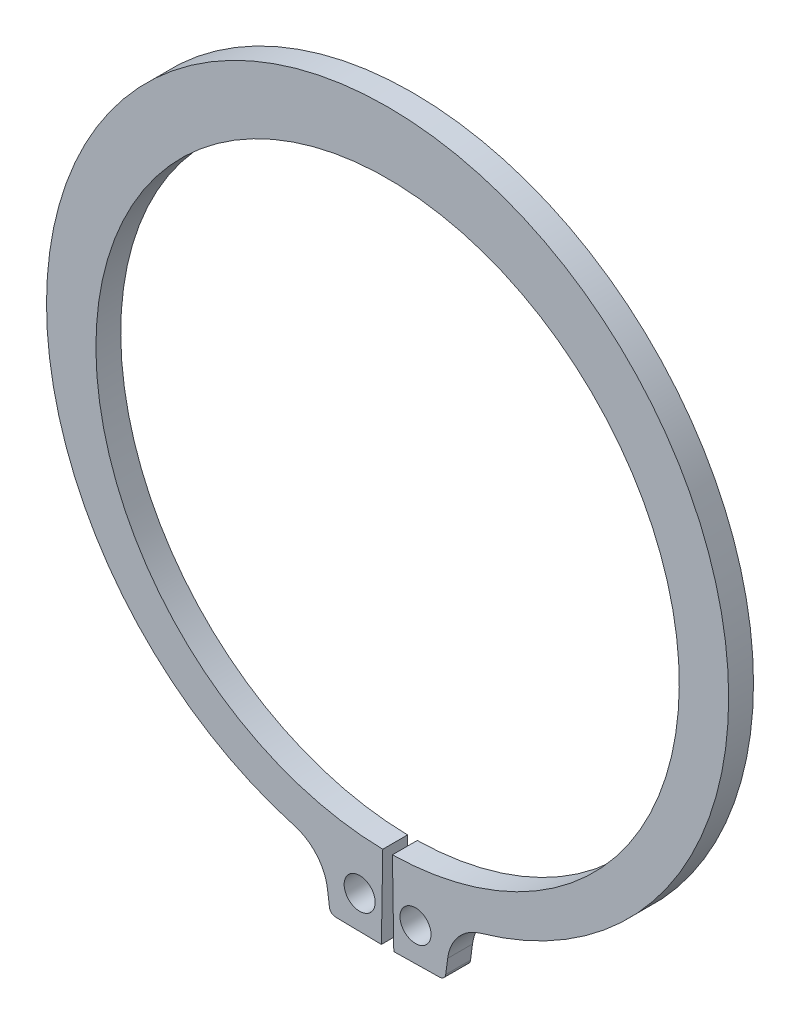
ISO-10303-21;
HEADER;
FILE_DESCRIPTION(('STEP AP214'),'2;1');
FILE_NAME('part.step','',(''),(''),'','','');
FILE_SCHEMA(('AUTOMOTIVE_DESIGN { 1 0 10303 214 1 1 1 1 }'));
ENDSEC;
DATA;
#1=APPLICATION_CONTEXT('core data for automotive mechanical design processes');
#2=APPLICATION_PROTOCOL_DEFINITION('international standard','automotive_design',2000,#1);
#3=PRODUCT_CONTEXT('',#1,'mechanical');
#4=PRODUCT('Part','Part','',(#3));
#5=PRODUCT_RELATED_PRODUCT_CATEGORY('part','',(#4));
#6=PRODUCT_DEFINITION_FORMATION('','',#4);
#7=PRODUCT_DEFINITION_CONTEXT('part definition',#1,'design');
#8=PRODUCT_DEFINITION('design','',#6,#7);
#9=PRODUCT_DEFINITION_SHAPE('','',#8);
#10=(LENGTH_UNIT() NAMED_UNIT(*) SI_UNIT(.MILLI.,.METRE.));
#11=(NAMED_UNIT(*) PLANE_ANGLE_UNIT() SI_UNIT($,.RADIAN.));
#12=(NAMED_UNIT(*) SI_UNIT($,.STERADIAN.) SOLID_ANGLE_UNIT());
#13=UNCERTAINTY_MEASURE_WITH_UNIT(LENGTH_MEASURE(1.E-05),#10,'distance_accuracy_value','');
#14=(GEOMETRIC_REPRESENTATION_CONTEXT(3) GLOBAL_UNCERTAINTY_ASSIGNED_CONTEXT((#13)) GLOBAL_UNIT_ASSIGNED_CONTEXT((#10,
#11,#12)) REPRESENTATION_CONTEXT('',''));
#15=CARTESIAN_POINT('',(0.,0.,0.));
#16=DIRECTION('',(0.,0.,1.));
#17=DIRECTION('',(1.,0.,0.));
#18=AXIS2_PLACEMENT_3D('',#15,#16,#17);
#19=CARTESIAN_POINT('',(0.,0.,-2.));
#20=DIRECTION('',(0.,0.,1.));
#21=DIRECTION('',(1.,0.,0.));
#22=AXIS2_PLACEMENT_3D('',#19,#20,#21);
#23=CYLINDRICAL_SURFACE('',#22,23.5);
#24=CARTESIAN_POINT('',(0.,0.,0.));
#25=DIRECTION('',(0.,0.,-1.));
#26=DIRECTION('',(1.,0.,0.));
#27=AXIS2_PLACEMENT_3D('',#24,#25,#26);
#28=CIRCLE('',#27,23.5);
#29=CARTESIAN_POINT('',(-0.389072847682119,-23.4967789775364,0.));
#30=VERTEX_POINT('',#29);
#31=CARTESIAN_POINT('',(0.389072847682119,-23.4967789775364,0.));
#32=VERTEX_POINT('',#31);
#33=EDGE_CURVE('E151',#30,#32,#28,.T.);
#34=ORIENTED_EDGE('',*,*,#33,.F.);
#35=DIRECTION('',(0.,0.,1.));
#36=VECTOR('',#35,1.);
#37=CARTESIAN_POINT('',(-0.389072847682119,-23.4967789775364,-2.));
#38=LINE('',#37,#36);
#39=CARTESIAN_POINT('',(-0.389072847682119,-23.4967789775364,-2.));
#40=VERTEX_POINT('',#39);
#41=EDGE_CURVE('E11',#40,#30,#38,.T.);
#42=ORIENTED_EDGE('',*,*,#41,.F.);
#43=CARTESIAN_POINT('',(0.,0.,-2.));
#44=DIRECTION('',(0.,0.,-1.));
#45=DIRECTION('',(1.,0.,0.));
#46=AXIS2_PLACEMENT_3D('',#43,#44,#45);
#47=CIRCLE('',#46,23.5);
#48=CARTESIAN_POINT('',(0.389072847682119,-23.4967789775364,-2.));
#49=VERTEX_POINT('',#48);
#50=EDGE_CURVE('E184',#40,#49,#47,.T.);
#51=ORIENTED_EDGE('',*,*,#50,.T.);
#52=DIRECTION('',(0.,0.,1.));
#53=VECTOR('',#52,1.);
#54=CARTESIAN_POINT('',(0.389072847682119,-23.4967789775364,-2.));
#55=LINE('',#54,#53);
#56=EDGE_CURVE('E33',#49,#32,#55,.T.);
#57=ORIENTED_EDGE('',*,*,#56,.T.);
#58=EDGE_LOOP('',(#34,#42,#51,#57));
#59=FACE_BOUND('',#58,.T.);
#60=ADVANCED_FACE('F30',(#59),#23,.F.);
#61=CARTESIAN_POINT('',(-0.389072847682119,-23.4967789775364,-2.));
#62=DIRECTION('',(0.999862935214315,-0.0165562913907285,0.));
#63=DIRECTION('',(0.0165562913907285,0.999862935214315,0.));
#64=AXIS2_PLACEMENT_3D('',#61,#62,#63);
#65=PLANE('',#64);
#66=DIRECTION('',(0.0165562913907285,0.999862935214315,0.));
#67=VECTOR('',#66,1.);
#68=CARTESIAN_POINT('',(-0.389072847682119,-23.4967789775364,0.));
#69=LINE('',#68,#67);
#70=CARTESIAN_POINT('',(-0.5,-30.1958606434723,0.));
#71=VERTEX_POINT('',#70);
#72=EDGE_CURVE('E182',#71,#30,#69,.T.);
#73=ORIENTED_EDGE('',*,*,#72,.F.);
#74=DIRECTION('',(0.,0.,1.));
#75=VECTOR('',#74,1.);
#76=CARTESIAN_POINT('',(-0.5,-30.1958606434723,-2.));
#77=LINE('',#76,#75);
#78=CARTESIAN_POINT('',(-0.5,-30.1958606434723,-2.));
#79=VERTEX_POINT('',#78);
#80=EDGE_CURVE('E39',#79,#71,#77,.T.);
#81=ORIENTED_EDGE('',*,*,#80,.F.);
#82=DIRECTION('',(0.0165562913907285,0.999862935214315,0.));
#83=VECTOR('',#82,1.);
#84=CARTESIAN_POINT('',(-0.389072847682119,-23.4967789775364,-2.));
#85=LINE('',#84,#83);
#86=EDGE_CURVE('E141',#79,#40,#85,.T.);
#87=ORIENTED_EDGE('',*,*,#86,.T.);
#88=ORIENTED_EDGE('',*,*,#41,.T.);
#89=EDGE_LOOP('',(#73,#81,#87,#88));
#90=FACE_BOUND('',#89,.T.);
#91=ADVANCED_FACE('F204',(#90),#65,.T.);
#92=CARTESIAN_POINT('',(-0.5,-30.1958606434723,-2.));
#93=DIRECTION('',(-0.0165562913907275,-0.999862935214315,0.));
#94=DIRECTION('',(0.999862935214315,-0.0165562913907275,0.));
#95=AXIS2_PLACEMENT_3D('',#92,#93,#94);
#96=PLANE('',#95);
#97=DIRECTION('',(0.999862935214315,-0.0165562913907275,0.));
#98=VECTOR('',#97,1.);
#99=CARTESIAN_POINT('',(-0.5,-30.1958606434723,0.));
#100=LINE('',#99,#98);
#101=CARTESIAN_POINT('',(-4.19512250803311,-30.134674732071,0.));
#102=VERTEX_POINT('',#101);
#103=EDGE_CURVE('E128',#102,#71,#100,.T.);
#104=ORIENTED_EDGE('',*,*,#103,.F.);
#105=DIRECTION('',(0.,0.,1.));
#106=VECTOR('',#105,1.);
#107=CARTESIAN_POINT('',(-4.19512250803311,-30.134674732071,-2.));
#108=LINE('',#107,#106);
#109=CARTESIAN_POINT('',(-4.19512250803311,-30.134674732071,-2.));
#110=VERTEX_POINT('',#109);
#111=EDGE_CURVE('E123',#110,#102,#108,.T.);
#112=ORIENTED_EDGE('',*,*,#111,.F.);
#113=DIRECTION('',(0.999862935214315,-0.0165562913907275,0.));
#114=VECTOR('',#113,1.);
#115=CARTESIAN_POINT('',(-0.5,-30.1958606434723,-2.));
#116=LINE('',#115,#114);
#117=EDGE_CURVE('E126',#110,#79,#116,.T.);
#118=ORIENTED_EDGE('',*,*,#117,.T.);
#119=ORIENTED_EDGE('',*,*,#80,.T.);
#120=EDGE_LOOP('',(#104,#112,#118,#119));
#121=FACE_BOUND('',#120,.T.);
#122=ADVANCED_FACE('F125',(#121),#96,.T.);
#123=CARTESIAN_POINT('',(-4.18684436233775,-29.6347432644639,-2.));
#124=DIRECTION('',(0.,0.,1.));
#125=DIRECTION('',(1.,0.,0.));
#126=AXIS2_PLACEMENT_3D('',#123,#124,#125);
#127=CYLINDRICAL_SURFACE('',#126,0.499999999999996);
#128=CARTESIAN_POINT('',(-4.18684436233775,-29.6347432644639,0.));
#129=DIRECTION('',(0.,0.,1.));
#130=DIRECTION('',(1.,0.,0.));
#131=AXIS2_PLACEMENT_3D('',#128,#129,#130);
#132=CIRCLE('',#131,0.499999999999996);
#133=CARTESIAN_POINT('',(-4.68256679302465,-29.7000063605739,0.));
#134=VERTEX_POINT('',#133);
#135=EDGE_CURVE('E179',#134,#102,#132,.T.);
#136=ORIENTED_EDGE('',*,*,#135,.F.);
#137=DIRECTION('',(0.,0.,1.));
#138=VECTOR('',#137,1.);
#139=CARTESIAN_POINT('',(-4.68256679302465,-29.7000063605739,-2.));
#140=LINE('',#139,#138);
#141=CARTESIAN_POINT('',(-4.68256679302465,-29.7000063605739,-2.));
#142=VERTEX_POINT('',#141);
#143=EDGE_CURVE('E133',#142,#134,#140,.T.);
#144=ORIENTED_EDGE('',*,*,#143,.F.);
#145=CARTESIAN_POINT('',(-4.18684436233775,-29.6347432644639,-2.));
#146=DIRECTION('',(0.,0.,1.));
#147=DIRECTION('',(1.,0.,0.));
#148=AXIS2_PLACEMENT_3D('',#145,#146,#147);
#149=CIRCLE('',#148,0.499999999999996);
#150=EDGE_CURVE('E139',#142,#110,#149,.T.);
#151=ORIENTED_EDGE('',*,*,#150,.T.);
#152=ORIENTED_EDGE('',*,*,#111,.T.);
#153=EDGE_LOOP('',(#136,#144,#151,#152));
#154=FACE_BOUND('',#153,.T.);
#155=ADVANCED_FACE('F143',(#154),#127,.T.);
#156=CARTESIAN_POINT('',(-4.84142055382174,-28.4933922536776,-2.));
#157=DIRECTION('',(-0.99144486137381,-0.130526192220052,0.));
#158=DIRECTION('',(0.130526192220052,-0.99144486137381,0.));
#159=AXIS2_PLACEMENT_3D('',#156,#157,#158);
#160=PLANE('',#159);
#161=DIRECTION('',(0.130526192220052,-0.99144486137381,0.));
#162=VECTOR('',#161,1.);
#163=CARTESIAN_POINT('',(-4.84142055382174,-28.4933922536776,0.));
#164=LINE('',#163,#162);
#165=CARTESIAN_POINT('',(-4.84142055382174,-28.4933922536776,0.));
#166=VERTEX_POINT('',#165);
#167=EDGE_CURVE('E176',#166,#134,#164,.T.);
#168=ORIENTED_EDGE('',*,*,#167,.F.);
#169=DIRECTION('',(0.,0.,1.));
#170=VECTOR('',#169,1.);
#171=CARTESIAN_POINT('',(-4.84142055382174,-28.4933922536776,-2.));
#172=LINE('',#171,#170);
#173=CARTESIAN_POINT('',(-4.84142055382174,-28.4933922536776,-2.));
#174=VERTEX_POINT('',#173);
#175=EDGE_CURVE('E188',#174,#166,#172,.T.);
#176=ORIENTED_EDGE('',*,*,#175,.F.);
#177=DIRECTION('',(0.130526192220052,-0.99144486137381,0.));
#178=VECTOR('',#177,1.);
#179=CARTESIAN_POINT('',(-4.84142055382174,-28.4933922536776,-2.));
#180=LINE('',#179,#178);
#181=EDGE_CURVE('E144',#174,#142,#180,.T.);
#182=ORIENTED_EDGE('',*,*,#181,.T.);
#183=ORIENTED_EDGE('',*,*,#143,.T.);
#184=EDGE_LOOP('',(#168,#176,#182,#183));
#185=FACE_BOUND('',#184,.T.);
#186=ADVANCED_FACE('F217',(#185),#160,.T.);
#187=CARTESIAN_POINT('',(-8.50958973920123,-28.9763158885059,-2.));
#188=DIRECTION('',(0.,0.,1.));
#189=DIRECTION('',(1.,0.,0.));
#190=AXIS2_PLACEMENT_3D('',#187,#188,#189);
#191=CYLINDRICAL_SURFACE('',#190,3.69982167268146);
#192=CARTESIAN_POINT('',(-8.50958973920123,-28.9763158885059,0.));
#193=DIRECTION('',(0.,0.,-1.));
#194=DIRECTION('',(1.,0.,0.));
#195=AXIS2_PLACEMENT_3D('',#192,#193,#194);
#196=CIRCLE('',#195,3.69982167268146);
#197=CARTESIAN_POINT('',(-7.49983812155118,-25.4169504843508,0.));
#198=VERTEX_POINT('',#197);
#199=EDGE_CURVE('E173',#198,#166,#196,.T.);
#200=ORIENTED_EDGE('',*,*,#199,.F.);
#201=DIRECTION('',(0.,0.,1.));
#202=VECTOR('',#201,1.);
#203=CARTESIAN_POINT('',(-7.49983812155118,-25.4169504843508,-2.));
#204=LINE('',#203,#202);
#205=CARTESIAN_POINT('',(-7.49983812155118,-25.4169504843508,-2.));
#206=VERTEX_POINT('',#205);
#207=EDGE_CURVE('E190',#206,#198,#204,.T.);
#208=ORIENTED_EDGE('',*,*,#207,.F.);
#209=CARTESIAN_POINT('',(-8.50958973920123,-28.9763158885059,-2.));
#210=DIRECTION('',(0.,0.,-1.));
#211=DIRECTION('',(1.,0.,0.));
#212=AXIS2_PLACEMENT_3D('',#209,#210,#211);
#213=CIRCLE('',#212,3.69982167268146);
#214=EDGE_CURVE('E146',#206,#174,#213,.T.);
#215=ORIENTED_EDGE('',*,*,#214,.T.);
#216=ORIENTED_EDGE('',*,*,#175,.T.);
#217=EDGE_LOOP('',(#200,#208,#215,#216));
#218=FACE_BOUND('',#217,.T.);
#219=ADVANCED_FACE('F220',(#218),#191,.F.);
#220=CARTESIAN_POINT('',(0.,1.01991169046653,-2.));
#221=DIRECTION('',(0.,0.,1.));
#222=DIRECTION('',(1.,0.,0.));
#223=AXIS2_PLACEMENT_3D('',#220,#221,#222);
#224=CYLINDRICAL_SURFACE('',#223,27.4800883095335);
#225=CARTESIAN_POINT('',(0.,1.01991169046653,0.));
#226=DIRECTION('',(0.,0.,1.));
#227=DIRECTION('',(1.,0.,0.));
#228=AXIS2_PLACEMENT_3D('',#225,#226,#227);
#229=CIRCLE('',#228,27.4800883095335);
#230=CARTESIAN_POINT('',(7.49983812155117,-25.4169504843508,0.));
#231=VERTEX_POINT('',#230);
#232=EDGE_CURVE('E170',#231,#198,#229,.T.);
#233=ORIENTED_EDGE('',*,*,#232,.F.);
#234=DIRECTION('',(0.,0.,1.));
#235=VECTOR('',#234,1.);
#236=CARTESIAN_POINT('',(7.49983812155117,-25.4169504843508,-2.));
#237=LINE('',#236,#235);
#238=CARTESIAN_POINT('',(7.49983812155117,-25.4169504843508,-2.));
#239=VERTEX_POINT('',#238);
#240=EDGE_CURVE('E192',#239,#231,#237,.T.);
#241=ORIENTED_EDGE('',*,*,#240,.F.);
#242=CARTESIAN_POINT('',(0.,1.01991169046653,-2.));
#243=DIRECTION('',(0.,0.,1.));
#244=DIRECTION('',(1.,0.,0.));
#245=AXIS2_PLACEMENT_3D('',#242,#243,#244);
#246=CIRCLE('',#245,27.4800883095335);
#247=EDGE_CURVE('E294',#239,#206,#246,.T.);
#248=ORIENTED_EDGE('',*,*,#247,.T.);
#249=ORIENTED_EDGE('',*,*,#207,.T.);
#250=EDGE_LOOP('',(#233,#241,#248,#249));
#251=FACE_BOUND('',#250,.T.);
#252=ADVANCED_FACE('F224',(#251),#224,.T.);
#253=CARTESIAN_POINT('',(8.50958973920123,-28.9763158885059,-2.));
#254=DIRECTION('',(0.,0.,1.));
#255=DIRECTION('',(1.,0.,0.));
#256=AXIS2_PLACEMENT_3D('',#253,#254,#255);
#257=CYLINDRICAL_SURFACE('',#256,3.69982167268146);
#258=CARTESIAN_POINT('',(8.50958973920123,-28.9763158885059,0.));
#259=DIRECTION('',(0.,0.,-1.));
#260=DIRECTION('',(1.,0.,0.));
#261=AXIS2_PLACEMENT_3D('',#258,#259,#260);
#262=CIRCLE('',#261,3.69982167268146);
#263=CARTESIAN_POINT('',(4.84142055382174,-28.4933922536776,0.));
#264=VERTEX_POINT('',#263);
#265=EDGE_CURVE('E167',#264,#231,#262,.T.);
#266=ORIENTED_EDGE('',*,*,#265,.F.);
#267=DIRECTION('',(0.,0.,1.));
#268=VECTOR('',#267,1.);
#269=CARTESIAN_POINT('',(4.84142055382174,-28.4933922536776,-2.));
#270=LINE('',#269,#268);
#271=CARTESIAN_POINT('',(4.84142055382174,-28.4933922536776,-2.));
#272=VERTEX_POINT('',#271);
#273=EDGE_CURVE('E194',#272,#264,#270,.T.);
#274=ORIENTED_EDGE('',*,*,#273,.F.);
#275=CARTESIAN_POINT('',(8.50958973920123,-28.9763158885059,-2.));
#276=DIRECTION('',(0.,0.,-1.));
#277=DIRECTION('',(1.,0.,0.));
#278=AXIS2_PLACEMENT_3D('',#275,#276,#277);
#279=CIRCLE('',#278,3.69982167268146);
#280=EDGE_CURVE('E291',#272,#239,#279,.T.);
#281=ORIENTED_EDGE('',*,*,#280,.T.);
#282=ORIENTED_EDGE('',*,*,#240,.T.);
#283=EDGE_LOOP('',(#266,#274,#281,#282));
#284=FACE_BOUND('',#283,.T.);
#285=ADVANCED_FACE('F228',(#284),#257,.F.);
#286=CARTESIAN_POINT('',(4.84142055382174,-28.4933922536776,-2.));
#287=DIRECTION('',(0.99144486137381,-0.130526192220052,0.));
#288=DIRECTION('',(0.130526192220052,0.99144486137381,0.));
#289=AXIS2_PLACEMENT_3D('',#286,#287,#288);
#290=PLANE('',#289);
#291=DIRECTION('',(0.130526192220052,0.99144486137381,0.));
#292=VECTOR('',#291,1.);
#293=CARTESIAN_POINT('',(4.84142055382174,-28.4933922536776,0.));
#294=LINE('',#293,#292);
#295=CARTESIAN_POINT('',(4.68256679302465,-29.7000063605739,0.));
#296=VERTEX_POINT('',#295);
#297=EDGE_CURVE('E164',#296,#264,#294,.T.);
#298=ORIENTED_EDGE('',*,*,#297,.F.);
#299=DIRECTION('',(0.,0.,1.));
#300=VECTOR('',#299,1.);
#301=CARTESIAN_POINT('',(4.68256679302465,-29.7000063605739,-2.));
#302=LINE('',#301,#300);
#303=CARTESIAN_POINT('',(4.68256679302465,-29.7000063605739,-2.));
#304=VERTEX_POINT('',#303);
#305=EDGE_CURVE('E196',#304,#296,#302,.T.);
#306=ORIENTED_EDGE('',*,*,#305,.F.);
#307=DIRECTION('',(0.130526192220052,0.99144486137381,0.));
#308=VECTOR('',#307,1.);
#309=CARTESIAN_POINT('',(4.84142055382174,-28.4933922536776,-2.));
#310=LINE('',#309,#308);
#311=EDGE_CURVE('E288',#304,#272,#310,.T.);
#312=ORIENTED_EDGE('',*,*,#311,.T.);
#313=ORIENTED_EDGE('',*,*,#273,.T.);
#314=EDGE_LOOP('',(#298,#306,#312,#313));
#315=FACE_BOUND('',#314,.T.);
#316=ADVANCED_FACE('F232',(#315),#290,.T.);
#317=CARTESIAN_POINT('',(4.18684436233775,-29.6347432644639,-2.));
#318=DIRECTION('',(0.,0.,1.));
#319=DIRECTION('',(1.,0.,0.));
#320=AXIS2_PLACEMENT_3D('',#317,#318,#319);
#321=CYLINDRICAL_SURFACE('',#320,0.499999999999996);
#322=CARTESIAN_POINT('',(4.18684436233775,-29.6347432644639,0.));
#323=DIRECTION('',(0.,0.,1.));
#324=DIRECTION('',(-1.,0.,0.));
#325=AXIS2_PLACEMENT_3D('',#322,#323,#324);
#326=CIRCLE('',#325,0.499999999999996);
#327=CARTESIAN_POINT('',(4.19512250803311,-30.134674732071,0.));
#328=VERTEX_POINT('',#327);
#329=EDGE_CURVE('E161',#328,#296,#326,.T.);
#330=ORIENTED_EDGE('',*,*,#329,.F.);
#331=DIRECTION('',(0.,0.,1.));
#332=VECTOR('',#331,1.);
#333=CARTESIAN_POINT('',(4.19512250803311,-30.134674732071,-2.));
#334=LINE('',#333,#332);
#335=CARTESIAN_POINT('',(4.19512250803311,-30.134674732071,-2.));
#336=VERTEX_POINT('',#335);
#337=EDGE_CURVE('E198',#336,#328,#334,.T.);
#338=ORIENTED_EDGE('',*,*,#337,.F.);
#339=CARTESIAN_POINT('',(4.18684436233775,-29.6347432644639,-2.));
#340=DIRECTION('',(0.,0.,1.));
#341=DIRECTION('',(-1.,0.,0.));
#342=AXIS2_PLACEMENT_3D('',#339,#340,#341);
#343=CIRCLE('',#342,0.499999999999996);
#344=EDGE_CURVE('E285',#336,#304,#343,.T.);
#345=ORIENTED_EDGE('',*,*,#344,.T.);
#346=ORIENTED_EDGE('',*,*,#305,.T.);
#347=EDGE_LOOP('',(#330,#338,#345,#346));
#348=FACE_BOUND('',#347,.T.);
#349=ADVANCED_FACE('F236',(#348),#321,.T.);
#350=CARTESIAN_POINT('',(0.5,-30.1958606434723,-2.));
#351=DIRECTION('',(0.0165562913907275,-0.999862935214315,0.));
#352=DIRECTION('',(0.999862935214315,0.0165562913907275,0.));
#353=AXIS2_PLACEMENT_3D('',#350,#351,#352);
#354=PLANE('',#353);
#355=DIRECTION('',(0.999862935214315,0.0165562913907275,0.));
#356=VECTOR('',#355,1.);
#357=CARTESIAN_POINT('',(0.5,-30.1958606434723,0.));
#358=LINE('',#357,#356);
#359=CARTESIAN_POINT('',(0.5,-30.1958606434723,0.));
#360=VERTEX_POINT('',#359);
#361=EDGE_CURVE('E158',#360,#328,#358,.T.);
#362=ORIENTED_EDGE('',*,*,#361,.F.);
#363=DIRECTION('',(0.,0.,1.));
#364=VECTOR('',#363,1.);
#365=CARTESIAN_POINT('',(0.5,-30.1958606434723,-2.));
#366=LINE('',#365,#364);
#367=CARTESIAN_POINT('',(0.5,-30.1958606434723,-2.));
#368=VERTEX_POINT('',#367);
#369=EDGE_CURVE('E199',#368,#360,#366,.T.);
#370=ORIENTED_EDGE('',*,*,#369,.F.);
#371=DIRECTION('',(0.999862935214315,0.0165562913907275,0.));
#372=VECTOR('',#371,1.);
#373=CARTESIAN_POINT('',(0.5,-30.1958606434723,-2.));
#374=LINE('',#373,#372);
#375=EDGE_CURVE('E282',#368,#336,#374,.T.);
#376=ORIENTED_EDGE('',*,*,#375,.T.);
#377=ORIENTED_EDGE('',*,*,#337,.T.);
#378=EDGE_LOOP('',(#362,#370,#376,#377));
#379=FACE_BOUND('',#378,.T.);
#380=ADVANCED_FACE('F240',(#379),#354,.T.);
#381=CARTESIAN_POINT('',(0.389072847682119,-23.4967789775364,-2.));
#382=DIRECTION('',(-0.999862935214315,-0.0165562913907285,0.));
#383=DIRECTION('',(0.0165562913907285,-0.999862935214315,0.));
#384=AXIS2_PLACEMENT_3D('',#381,#382,#383);
#385=PLANE('',#384);
#386=DIRECTION('',(0.0165562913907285,-0.999862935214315,0.));
#387=VECTOR('',#386,1.);
#388=CARTESIAN_POINT('',(0.389072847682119,-23.4967789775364,0.));
#389=LINE('',#388,#387);
#390=EDGE_CURVE('E154',#32,#360,#389,.T.);
#391=ORIENTED_EDGE('',*,*,#390,.F.);
#392=ORIENTED_EDGE('',*,*,#56,.F.);
#393=DIRECTION('',(0.0165562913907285,-0.999862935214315,0.));
#394=VECTOR('',#393,1.);
#395=CARTESIAN_POINT('',(0.389072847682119,-23.4967789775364,-2.));
#396=LINE('',#395,#394);
#397=EDGE_CURVE('E280',#49,#368,#396,.T.);
#398=ORIENTED_EDGE('',*,*,#397,.T.);
#399=ORIENTED_EDGE('',*,*,#369,.T.);
#400=EDGE_LOOP('',(#391,#392,#398,#399));
#401=FACE_BOUND('',#400,.T.);
#402=ADVANCED_FACE('F201',(#401),#385,.T.);
#403=CARTESIAN_POINT('',(0.,0.,-2.));
#404=DIRECTION('',(0.,0.,1.));
#405=DIRECTION('',(1.,0.,0.));
#406=AXIS2_PLACEMENT_3D('',#403,#404,#405);
#407=PLANE('',#406);
#408=CARTESIAN_POINT('',(-2.25,-27.5081351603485,-2.));
#409=DIRECTION('',(0.,0.,1.));
#410=DIRECTION('',(1.,0.,0.));
#411=AXIS2_PLACEMENT_3D('',#408,#409,#410);
#412=CIRCLE('',#411,1.25);
#413=CARTESIAN_POINT('',(-0.999999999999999,-27.5081351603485,-2.));
#414=VERTEX_POINT('',#413);
#415=EDGE_CURVE('E267',#414,#414,#412,.T.);
#416=ORIENTED_EDGE('',*,*,#415,.T.);
#417=EDGE_LOOP('',(#416));
#418=FACE_BOUND('',#417,.T.);
#419=CARTESIAN_POINT('',(2.25,-27.5081351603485,-2.));
#420=DIRECTION('',(0.,0.,1.));
#421=DIRECTION('',(1.,0.,0.));
#422=AXIS2_PLACEMENT_3D('',#419,#420,#421);
#423=CIRCLE('',#422,1.25);
#424=CARTESIAN_POINT('',(3.5,-27.5081351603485,-2.));
#425=VERTEX_POINT('',#424);
#426=EDGE_CURVE('E155',#425,#425,#423,.T.);
#427=ORIENTED_EDGE('',*,*,#426,.T.);
#428=EDGE_LOOP('',(#427));
#429=FACE_BOUND('',#428,.T.);
#430=ORIENTED_EDGE('',*,*,#50,.F.);
#431=ORIENTED_EDGE('',*,*,#86,.F.);
#432=ORIENTED_EDGE('',*,*,#117,.F.);
#433=ORIENTED_EDGE('',*,*,#150,.F.);
#434=ORIENTED_EDGE('',*,*,#181,.F.);
#435=ORIENTED_EDGE('',*,*,#214,.F.);
#436=ORIENTED_EDGE('',*,*,#247,.F.);
#437=ORIENTED_EDGE('',*,*,#280,.F.);
#438=ORIENTED_EDGE('',*,*,#311,.F.);
#439=ORIENTED_EDGE('',*,*,#344,.F.);
#440=ORIENTED_EDGE('',*,*,#375,.F.);
#441=ORIENTED_EDGE('',*,*,#397,.F.);
#442=EDGE_LOOP('',(#430,#431,#432,#433,#434,#435,#436,#437,#438,#439,#440,#441));
#443=FACE_BOUND('',#442,.T.);
#444=ADVANCED_FACE('F137',(#418,#429,#443),#407,.F.);
#445=CARTESIAN_POINT('',(0.,0.,0.));
#446=DIRECTION('',(0.,0.,1.));
#447=DIRECTION('',(1.,0.,0.));
#448=AXIS2_PLACEMENT_3D('',#445,#446,#447);
#449=PLANE('',#448);
#450=CARTESIAN_POINT('',(-2.25,-27.5081351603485,0.));
#451=DIRECTION('',(0.,0.,1.));
#452=DIRECTION('',(1.,0.,0.));
#453=AXIS2_PLACEMENT_3D('',#450,#451,#452);
#454=CIRCLE('',#453,1.25);
#455=CARTESIAN_POINT('',(-0.999999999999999,-27.5081351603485,0.));
#456=VERTEX_POINT('',#455);
#457=EDGE_CURVE('E270',#456,#456,#454,.T.);
#458=ORIENTED_EDGE('',*,*,#457,.F.);
#459=EDGE_LOOP('',(#458));
#460=FACE_BOUND('',#459,.T.);
#461=CARTESIAN_POINT('',(2.25,-27.5081351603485,0.));
#462=DIRECTION('',(0.,0.,1.));
#463=DIRECTION('',(1.,0.,0.));
#464=AXIS2_PLACEMENT_3D('',#461,#462,#463);
#465=CIRCLE('',#464,1.25);
#466=CARTESIAN_POINT('',(3.5,-27.5081351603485,0.));
#467=VERTEX_POINT('',#466);
#468=EDGE_CURVE('E272',#467,#467,#465,.T.);
#469=ORIENTED_EDGE('',*,*,#468,.F.);
#470=EDGE_LOOP('',(#469));
#471=FACE_BOUND('',#470,.T.);
#472=ORIENTED_EDGE('',*,*,#33,.T.);
#473=ORIENTED_EDGE('',*,*,#390,.T.);
#474=ORIENTED_EDGE('',*,*,#361,.T.);
#475=ORIENTED_EDGE('',*,*,#329,.T.);
#476=ORIENTED_EDGE('',*,*,#297,.T.);
#477=ORIENTED_EDGE('',*,*,#265,.T.);
#478=ORIENTED_EDGE('',*,*,#232,.T.);
#479=ORIENTED_EDGE('',*,*,#199,.T.);
#480=ORIENTED_EDGE('',*,*,#167,.T.);
#481=ORIENTED_EDGE('',*,*,#135,.T.);
#482=ORIENTED_EDGE('',*,*,#103,.T.);
#483=ORIENTED_EDGE('',*,*,#72,.T.);
#484=EDGE_LOOP('',(#472,#473,#474,#475,#476,#477,#478,#479,#480,#481,#482,#483));
#485=FACE_BOUND('',#484,.T.);
#486=ADVANCED_FACE('F203',(#460,#471,#485),#449,.T.);
#487=CARTESIAN_POINT('',(2.25,-27.5081351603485,-2.));
#488=DIRECTION('',(0.,0.,1.));
#489=DIRECTION('',(1.,0.,0.));
#490=AXIS2_PLACEMENT_3D('',#487,#488,#489);
#491=CYLINDRICAL_SURFACE('',#490,1.25);
#492=ORIENTED_EDGE('',*,*,#426,.F.);
#493=EDGE_LOOP('',(#492));
#494=FACE_BOUND('',#493,.T.);
#495=ORIENTED_EDGE('',*,*,#468,.T.);
#496=EDGE_LOOP('',(#495));
#497=FACE_BOUND('',#496,.T.);
#498=ADVANCED_FACE('F252',(#494,#497),#491,.F.);
#499=CARTESIAN_POINT('',(-2.25,-27.5081351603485,-2.));
#500=DIRECTION('',(0.,0.,1.));
#501=DIRECTION('',(1.,0.,0.));
#502=AXIS2_PLACEMENT_3D('',#499,#500,#501);
#503=CYLINDRICAL_SURFACE('',#502,1.25);
#504=ORIENTED_EDGE('',*,*,#415,.F.);
#505=EDGE_LOOP('',(#504));
#506=FACE_BOUND('',#505,.T.);
#507=ORIENTED_EDGE('',*,*,#457,.T.);
#508=EDGE_LOOP('',(#507));
#509=FACE_BOUND('',#508,.T.);
#510=ADVANCED_FACE('F259',(#506,#509),#503,.F.);
#511=CLOSED_SHELL('',(#60,#91,#122,#155,#186,#219,#252,#285,#316,#349,#380,#402,#444,#486,#498,#510));
#512=MANIFOLD_SOLID_BREP('B2',#511);
#513=ADVANCED_BREP_SHAPE_REPRESENTATION('',(#18,#512),#14);
#514=SHAPE_DEFINITION_REPRESENTATION(#9,#513);
ENDSEC;
END-ISO-10303-21;
